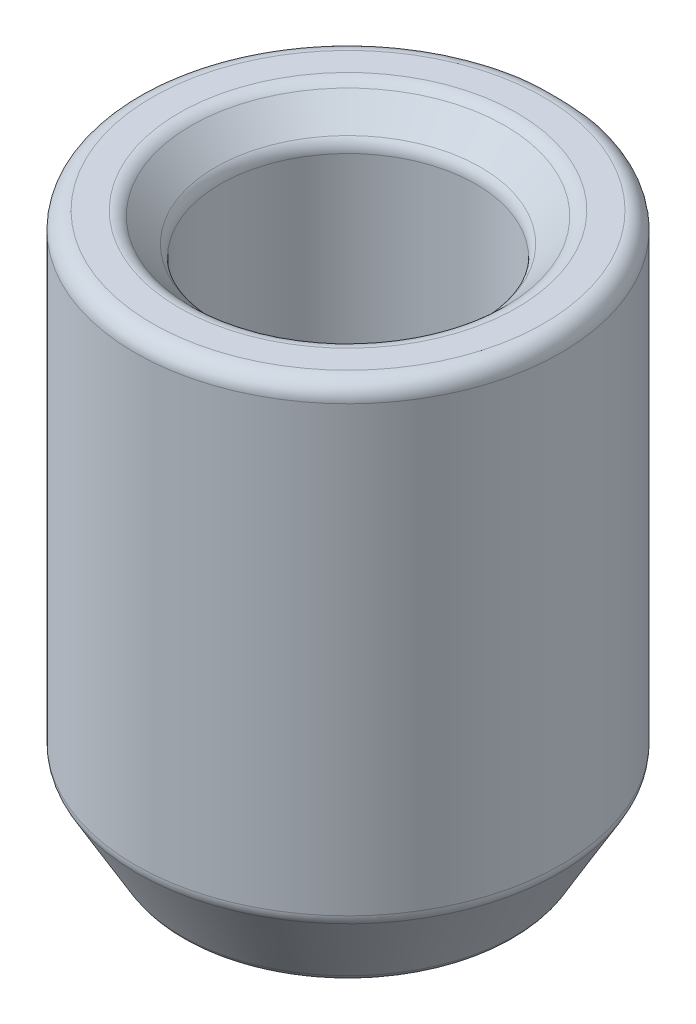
ISO-10303-21;
HEADER;
FILE_DESCRIPTION(('STEP AP214'),'2;1');
FILE_NAME('part.step','',(''),(''),'','','');
FILE_SCHEMA(('AUTOMOTIVE_DESIGN { 1 0 10303 214 1 1 1 1 }'));
ENDSEC;
DATA;
#1=APPLICATION_CONTEXT('core data for automotive mechanical design processes');
#2=APPLICATION_PROTOCOL_DEFINITION('international standard','automotive_design',2000,#1);
#3=PRODUCT_CONTEXT('',#1,'mechanical');
#4=PRODUCT('Part','Part','',(#3));
#5=PRODUCT_RELATED_PRODUCT_CATEGORY('part','',(#4));
#6=PRODUCT_DEFINITION_FORMATION('','',#4);
#7=PRODUCT_DEFINITION_CONTEXT('part definition',#1,'design');
#8=PRODUCT_DEFINITION('design','',#6,#7);
#9=PRODUCT_DEFINITION_SHAPE('','',#8);
#10=(LENGTH_UNIT() NAMED_UNIT(*) SI_UNIT(.MILLI.,.METRE.));
#11=(NAMED_UNIT(*) PLANE_ANGLE_UNIT() SI_UNIT($,.RADIAN.));
#12=(NAMED_UNIT(*) SI_UNIT($,.STERADIAN.) SOLID_ANGLE_UNIT());
#13=UNCERTAINTY_MEASURE_WITH_UNIT(LENGTH_MEASURE(1.E-05),#10,'distance_accuracy_value','');
#14=(GEOMETRIC_REPRESENTATION_CONTEXT(3) GLOBAL_UNCERTAINTY_ASSIGNED_CONTEXT((#13)) GLOBAL_UNIT_ASSIGNED_CONTEXT((#10,
#11,#12)) REPRESENTATION_CONTEXT('',''));
#15=CARTESIAN_POINT('',(0.,0.,0.));
#16=DIRECTION('',(0.,0.,1.));
#17=DIRECTION('',(1.,0.,0.));
#18=AXIS2_PLACEMENT_3D('',#15,#16,#17);
#19=CARTESIAN_POINT('',(1.25,3.25,0.));
#20=DIRECTION('',(0.,1.,0.));
#21=DIRECTION('',(0.,0.,1.));
#22=AXIS2_PLACEMENT_3D('',#19,#20,#21);
#23=PLANE('',#22);
#24=CARTESIAN_POINT('',(0.,3.25,0.));
#25=DIRECTION('',(0.,1.,0.));
#26=DIRECTION('',(0.,0.,1.));
#27=AXIS2_PLACEMENT_3D('',#24,#25,#26);
#28=CIRCLE('',#27,0.991421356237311);
#29=CARTESIAN_POINT('',(0.,3.25,0.991421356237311));
#30=VERTEX_POINT('',#29);
#31=EDGE_CURVE('E75',#30,#30,#28,.F.);
#32=ORIENTED_EDGE('',*,*,#31,.T.);
#33=EDGE_LOOP('',(#32));
#34=FACE_BOUND('',#33,.T.);
#35=CARTESIAN_POINT('',(0.,3.25,0.));
#36=DIRECTION('',(0.,1.,0.));
#37=DIRECTION('',(0.,0.,1.));
#38=AXIS2_PLACEMENT_3D('',#35,#36,#37);
#39=CIRCLE('',#38,1.15);
#40=CARTESIAN_POINT('',(0.322,3.25,-1.104));
#41=VERTEX_POINT('',#40);
#42=EDGE_CURVE('E30',#41,#41,#39,.T.);
#43=ORIENTED_EDGE('',*,*,#42,.T.);
#44=EDGE_LOOP('',(#43));
#45=FACE_BOUND('',#44,.T.);
#46=ADVANCED_FACE('F16',(#34,#45),#23,.T.);
#47=CARTESIAN_POINT('',(0.,-0.940962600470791,0.));
#48=DIRECTION('',(0.,-1.,0.));
#49=DIRECTION('',(0.,0.,-1.));
#50=AXIS2_PLACEMENT_3D('',#47,#48,#49);
#51=CYLINDRICAL_SURFACE('',#50,1.25);
#52=DIRECTION('',(0.,-1.,0.));
#53=VECTOR('',#52,1.);
#54=CARTESIAN_POINT('',(0.35,3.25,-1.2));
#55=LINE('',#54,#53);
#56=CARTESIAN_POINT('',(0.35,3.15,-1.2));
#57=VERTEX_POINT('',#56);
#58=CARTESIAN_POINT('',(0.35,0.546410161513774,-1.2));
#59=VERTEX_POINT('',#58);
#60=EDGE_CURVE('E56',#57,#59,#55,.T.);
#61=ORIENTED_EDGE('',*,*,#60,.F.);
#62=CARTESIAN_POINT('',(0.,3.15,0.));
#63=DIRECTION('',(0.,1.,0.));
#64=DIRECTION('',(0.,0.,1.));
#65=AXIS2_PLACEMENT_3D('',#62,#63,#64);
#66=CIRCLE('',#65,1.25);
#67=CARTESIAN_POINT('',(-0.35,3.15,-1.2));
#68=VERTEX_POINT('',#67);
#69=EDGE_CURVE('E67',#57,#68,#66,.F.);
#70=ORIENTED_EDGE('',*,*,#69,.T.);
#71=DIRECTION('',(0.,-1.,0.));
#72=VECTOR('',#71,1.);
#73=CARTESIAN_POINT('',(-0.35,3.25,-1.2));
#74=LINE('',#73,#72);
#75=CARTESIAN_POINT('',(-0.35,0.546410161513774,-1.2));
#76=VERTEX_POINT('',#75);
#77=EDGE_CURVE('E58',#68,#76,#74,.T.);
#78=ORIENTED_EDGE('',*,*,#77,.T.);
#79=CARTESIAN_POINT('',(0.,0.546410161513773,0.));
#80=DIRECTION('',(0.,-1.,0.));
#81=DIRECTION('',(0.,0.,-1.));
#82=AXIS2_PLACEMENT_3D('',#79,#80,#81);
#83=CIRCLE('',#82,1.25);
#84=EDGE_CURVE('E69',#76,#59,#83,.F.);
#85=ORIENTED_EDGE('',*,*,#84,.T.);
#86=EDGE_LOOP('',(#61,#70,#78,#85));
#87=FACE_BOUND('',#86,.T.);
#88=ADVANCED_FACE('F66',(#87),#51,.T.);
#89=CARTESIAN_POINT('',(0.,0.,0.));
#90=DIRECTION('',(0.,1.,0.));
#91=DIRECTION('',(0.,0.,1.));
#92=AXIS2_PLACEMENT_3D('',#89,#90,#91);
#93=CONICAL_SURFACE('',#92,0.95,0.523598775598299);
#94=CARTESIAN_POINT('',(0.,0.05,0.));
#95=DIRECTION('',(0.,-1.,0.));
#96=DIRECTION('',(0.,0.,-1.));
#97=AXIS2_PLACEMENT_3D('',#94,#95,#96);
#98=CIRCLE('',#97,0.978867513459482);
#99=CARTESIAN_POINT('',(0.,0.05,-0.978867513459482));
#100=VERTEX_POINT('',#99);
#101=EDGE_CURVE('E62',#100,#100,#98,.F.);
#102=ORIENTED_EDGE('',*,*,#101,.T.);
#103=EDGE_LOOP('',(#102));
#104=FACE_BOUND('',#103,.T.);
#105=CARTESIAN_POINT('',(-1.69990741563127,1.95858498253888,-1.2));
#106=CARTESIAN_POINT('',(-1.64529047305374,1.88136673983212,-1.2));
#107=CARTESIAN_POINT('',(-1.59014059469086,1.80450944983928,-1.2));
#108=CARTESIAN_POINT('',(-1.47824642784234,1.65181540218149,-1.2));
#109=CARTESIAN_POINT('',(-1.4215001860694,1.57598007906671,-1.2));
#110=CARTESIAN_POINT('',(-1.30479796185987,1.42423646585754,-1.2));
#111=CARTESIAN_POINT('',(-1.24479943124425,1.34836073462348,-1.2));
#112=CARTESIAN_POINT('',(-1.12197769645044,1.19897037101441,-1.2));
#113=CARTESIAN_POINT('',(-1.05915615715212,1.12545438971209,-1.2));
#114=CARTESIAN_POINT('',(-0.958705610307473,1.01446205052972,-1.2));
#115=CARTESIAN_POINT('',(-0.922504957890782,0.975696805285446,-1.2));
#116=CARTESIAN_POINT('',(-0.848574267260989,0.899659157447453,-1.2));
#117=CARTESIAN_POINT('',(-0.81084457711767,0.862386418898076,-1.2));
#118=CARTESIAN_POINT('',(-0.733602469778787,0.789990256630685,-1.2));
#119=CARTESIAN_POINT('',(-0.694096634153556,0.754859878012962,-1.2));
#120=CARTESIAN_POINT('',(-0.612731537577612,0.687466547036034,-1.2));
#121=CARTESIAN_POINT('',(-0.570874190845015,0.655201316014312,-1.2));
#122=CARTESIAN_POINT('',(-0.481844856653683,0.593135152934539,-1.2));
#123=CARTESIAN_POINT('',(-0.434507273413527,0.563566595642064,-1.2));
#124=CARTESIAN_POINT('',(-0.336086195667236,0.511478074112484,-1.2));
#125=CARTESIAN_POINT('',(-0.285012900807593,0.488939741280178,-1.2));
#126=CARTESIAN_POINT('',(-0.192875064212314,0.458629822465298,-1.2));
#127=CARTESIAN_POINT('',(-0.152586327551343,0.448556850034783,-1.2));
#128=CARTESIAN_POINT('',(-0.0708904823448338,0.435450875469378,-1.2));
#129=CARTESIAN_POINT('',(-0.0294851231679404,0.432407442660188,-1.2));
#130=CARTESIAN_POINT('',(0.0532651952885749,0.433822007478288,-1.2));
#131=CARTESIAN_POINT('',(0.094609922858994,0.438293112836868,-1.2));
#132=CARTESIAN_POINT('',(0.175949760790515,0.454063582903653,-1.2));
#133=CARTESIAN_POINT('',(0.21594365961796,0.465368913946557,-1.2));
#134=CARTESIAN_POINT('',(0.313609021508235,0.50051121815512,-1.2));
#135=CARTESIAN_POINT('',(0.370021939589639,0.52779285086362,-1.2));
#136=CARTESIAN_POINT('',(0.451349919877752,0.57472194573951,-1.2));
#137=CARTESIAN_POINT('',(0.478063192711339,0.591487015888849,-1.2));
#138=CARTESIAN_POINT('',(0.53041184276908,0.6266147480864,-1.2));
#139=CARTESIAN_POINT('',(0.556047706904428,0.644976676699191,-1.2));
#140=CARTESIAN_POINT('',(0.632850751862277,0.702951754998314,-1.2));
#141=CARTESIAN_POINT('',(0.682482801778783,0.744586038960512,-1.2));
#142=CARTESIAN_POINT('',(0.77870401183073,0.831261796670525,-1.2));
#143=CARTESIAN_POINT('',(0.825289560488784,0.876307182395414,-1.2));
#144=CARTESIAN_POINT('',(0.916347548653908,0.968932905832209,-1.2));
#145=CARTESIAN_POINT('',(0.960807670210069,1.01652526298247,-1.2));
#146=CARTESIAN_POINT('',(1.04790550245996,1.11335174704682,-1.2));
#147=CARTESIAN_POINT('',(1.09054287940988,1.16258617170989,-1.2));
#148=CARTESIAN_POINT('',(1.17043595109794,1.25756361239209,-1.2));
#149=CARTESIAN_POINT('',(1.20782037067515,1.30319889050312,-1.2));
#150=CARTESIAN_POINT('',(1.28163555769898,1.39524280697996,-1.2));
#151=CARTESIAN_POINT('',(1.31806619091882,1.44165155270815,-1.2));
#152=CARTESIAN_POINT('',(1.38969935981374,1.53450725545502,-1.2));
#153=CARTESIAN_POINT('',(1.42491144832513,1.58094686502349,-1.2));
#154=CARTESIAN_POINT('',(1.4946764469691,1.67429900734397,-1.2));
#155=CARTESIAN_POINT('',(1.52922953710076,1.72121140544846,-1.2));
#156=CARTESIAN_POINT('',(1.56351832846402,1.76831339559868,-1.2));
#157=B_SPLINE_CURVE_WITH_KNOTS('',3,(#105,#106,#107,#108,#109,#110,#111,#112,#113,#114,#115,
#116,#117,#118,#119,#120,#121,#122,#123,#124,#125,#126,#127,#128,#129,#130,#131,#132,#133,#134,
#135,#136,#137,#138,#139,#140,#141,#142,#143,#144,#145,#146,#147,#148,#149,#150,#151,#152,#153,
#154,#155,#156),.UNSPECIFIED.,.F.,.F.,(4,2,2,2,2,2,2,2,2,2,2,2,2,2,2,2,2,2,2,2,2,2,2,2,2,4),(0.,
0.283762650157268,0.567889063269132,0.858040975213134,1.14802395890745,1.30711208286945,
1.4661641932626,1.62466896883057,1.78304653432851,1.95011473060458,2.11674268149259,
2.24080792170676,2.36468895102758,2.48878629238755,2.61299212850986,2.79984676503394,
2.89443418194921,2.98897838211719,3.18305878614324,3.37736524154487,3.57268733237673,
3.76804503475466,3.94500882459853,4.12199738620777,4.29683065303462,4.4716154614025),.UNSPECIFIED.);
#158=CARTESIAN_POINT('',(-0.298639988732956,0.496410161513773,-1.2));
#159=VERTEX_POINT('',#158);
#160=CARTESIAN_POINT('',(0.298639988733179,0.496410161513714,-1.2));
#161=VERTEX_POINT('',#160);
#162=EDGE_CURVE('E133',#159,#161,#157,.T.);
#163=ORIENTED_EDGE('',*,*,#162,.T.);
#164=CARTESIAN_POINT('',(0.,0.496410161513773,0.));
#165=DIRECTION('',(0.,-1.,0.));
#166=DIRECTION('',(0.,0.,-1.));
#167=AXIS2_PLACEMENT_3D('',#164,#165,#166);
#168=CIRCLE('',#167,1.23660254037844);
#169=EDGE_CURVE('E25',#161,#159,#168,.T.);
#170=ORIENTED_EDGE('',*,*,#169,.T.);
#171=EDGE_LOOP('',(#163,#170));
#172=FACE_BOUND('',#171,.T.);
#173=ADVANCED_FACE('F113',(#104,#172),#93,.T.);
#174=CARTESIAN_POINT('',(0.,1.4,0.));
#175=DIRECTION('',(0.,-1.,0.));
#176=DIRECTION('',(1.,0.,0.));
#177=AXIS2_PLACEMENT_3D('',#174,#175,#176);
#178=SPHERICAL_SURFACE('',#177,0.75);
#179=CARTESIAN_POINT('',(0.,1.4,0.));
#180=DIRECTION('',(0.,-1.,0.));
#181=DIRECTION('',(0.,0.,-1.));
#182=AXIS2_PLACEMENT_3D('',#179,#180,#181);
#183=CIRCLE('',#182,0.75);
#184=CARTESIAN_POINT('',(0.,1.4,-0.75));
#185=VERTEX_POINT('',#184);
#186=EDGE_CURVE('E20',#185,#185,#183,.T.);
#187=ORIENTED_EDGE('',*,*,#186,.F.);
#188=EDGE_LOOP('',(#187));
#189=FACE_BOUND('',#188,.T.);
#190=ADVANCED_FACE('F18',(#189),#178,.F.);
#191=CARTESIAN_POINT('',(0.,-0.940962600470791,0.));
#192=DIRECTION('',(0.,-1.,0.));
#193=DIRECTION('',(0.,0.,-1.));
#194=AXIS2_PLACEMENT_3D('',#191,#192,#193);
#195=CYLINDRICAL_SURFACE('',#194,0.75);
#196=CARTESIAN_POINT('',(0.,3.00857864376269,0.));
#197=DIRECTION('',(0.,-1.,0.));
#198=DIRECTION('',(0.,0.,-1.));
#199=AXIS2_PLACEMENT_3D('',#196,#197,#198);
#200=CIRCLE('',#199,0.75);
#201=CARTESIAN_POINT('',(0.,3.00857864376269,-0.75));
#202=VERTEX_POINT('',#201);
#203=EDGE_CURVE('E139',#202,#202,#200,.F.);
#204=ORIENTED_EDGE('',*,*,#203,.T.);
#205=EDGE_LOOP('',(#204));
#206=FACE_BOUND('',#205,.T.);
#207=ORIENTED_EDGE('',*,*,#186,.T.);
#208=EDGE_LOOP('',(#207));
#209=FACE_BOUND('',#208,.T.);
#210=ADVANCED_FACE('F118',(#206,#209),#195,.F.);
#211=CARTESIAN_POINT('',(0.,0.,0.));
#212=DIRECTION('',(0.,-1.,0.));
#213=DIRECTION('',(0.,0.,-1.));
#214=AXIS2_PLACEMENT_3D('',#211,#212,#213);
#215=PLANE('',#214);
#216=CARTESIAN_POINT('',(0.,0.,0.));
#217=DIRECTION('',(0.,-1.,0.));
#218=DIRECTION('',(0.,0.,-1.));
#219=AXIS2_PLACEMENT_3D('',#216,#217,#218);
#220=CIRCLE('',#219,0.892264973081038);
#221=CARTESIAN_POINT('',(0.,0.,-0.892264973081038));
#222=VERTEX_POINT('',#221);
#223=EDGE_CURVE('E11',#222,#222,#220,.T.);
#224=ORIENTED_EDGE('',*,*,#223,.T.);
#225=EDGE_LOOP('',(#224));
#226=FACE_BOUND('',#225,.T.);
#227=ADVANCED_FACE('F121',(#226),#215,.T.);
#228=CARTESIAN_POINT('',(0.,3.25,0.));
#229=DIRECTION('',(0.,1.,0.));
#230=DIRECTION('',(0.,0.,1.));
#231=AXIS2_PLACEMENT_3D('',#228,#229,#230);
#232=CONICAL_SURFACE('',#231,0.95,0.785398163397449);
#233=CARTESIAN_POINT('',(0.,3.07928932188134,0.));
#234=DIRECTION('',(0.,-1.,0.));
#235=DIRECTION('',(0.,0.,-1.));
#236=AXIS2_PLACEMENT_3D('',#233,#234,#235);
#237=CIRCLE('',#236,0.779289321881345);
#238=CARTESIAN_POINT('',(0.,3.07928932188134,-0.779289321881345));
#239=VERTEX_POINT('',#238);
#240=EDGE_CURVE('E145',#239,#239,#237,.T.);
#241=ORIENTED_EDGE('',*,*,#240,.T.);
#242=EDGE_LOOP('',(#241));
#243=FACE_BOUND('',#242,.T.);
#244=CARTESIAN_POINT('',(0.,3.22071067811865,0.));
#245=DIRECTION('',(0.,-1.,0.));
#246=DIRECTION('',(0.,0.,-1.));
#247=AXIS2_PLACEMENT_3D('',#244,#245,#246);
#248=CIRCLE('',#247,0.920710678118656);
#249=CARTESIAN_POINT('',(0.,3.22071067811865,-0.920710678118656));
#250=VERTEX_POINT('',#249);
#251=EDGE_CURVE('E142',#250,#250,#248,.F.);
#252=ORIENTED_EDGE('',*,*,#251,.T.);
#253=EDGE_LOOP('',(#252));
#254=FACE_BOUND('',#253,.T.);
#255=ADVANCED_FACE('F123',(#243,#254),#232,.F.);
#256=CARTESIAN_POINT('',(-0.35,3.25,-1.2));
#257=DIRECTION('',(0.,0.,-1.));
#258=DIRECTION('',(-1.,0.,0.));
#259=AXIS2_PLACEMENT_3D('',#256,#257,#258);
#260=PLANE('',#259);
#261=ORIENTED_EDGE('',*,*,#77,.F.);
#262=CARTESIAN_POINT('',(-0.35,3.15,-1.2));
#263=CARTESIAN_POINT('',(-0.350006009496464,3.151856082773,-1.2));
#264=CARTESIAN_POINT('',(-0.349815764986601,3.15370357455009,-1.2));
#265=CARTESIAN_POINT('',(-0.349100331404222,3.15730650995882,-1.2));
#266=CARTESIAN_POINT('',(-0.348579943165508,3.15906288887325,-1.2));
#267=CARTESIAN_POINT('',(-0.347111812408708,3.16284308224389,-1.2));
#268=CARTESIAN_POINT('',(-0.346094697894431,3.16483932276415,-1.2));
#269=CARTESIAN_POINT('',(-0.343752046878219,3.16865069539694,-1.2));
#270=CARTESIAN_POINT('',(-0.34242476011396,3.17046471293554,-1.2));
#271=CARTESIAN_POINT('',(-0.338578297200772,3.17508718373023,-1.2));
#272=CARTESIAN_POINT('',(-0.335863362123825,3.17773068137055,-1.2));
#273=CARTESIAN_POINT('',(-0.330092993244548,3.18260417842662,-1.2));
#274=CARTESIAN_POINT('',(-0.327036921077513,3.18483338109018,-1.2));
#275=CARTESIAN_POINT('',(-0.31517330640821,3.19263355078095,-1.2));
#276=CARTESIAN_POINT('',(-0.305708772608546,3.19718164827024,-1.2));
#277=CARTESIAN_POINT('',(-0.286266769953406,3.2049959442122,-1.2));
#278=CARTESIAN_POINT('',(-0.276286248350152,3.20825320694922,-1.2));
#279=CARTESIAN_POINT('',(-0.247696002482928,3.2162918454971,-1.2));
#280=CARTESIAN_POINT('',(-0.228810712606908,3.22008888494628,-1.2));
#281=CARTESIAN_POINT('',(-0.190789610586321,3.22617779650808,-1.2));
#282=CARTESIAN_POINT('',(-0.171653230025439,3.22846526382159,-1.2));
#283=CARTESIAN_POINT('',(-0.133287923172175,3.23206094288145,-1.2));
#284=CARTESIAN_POINT('',(-0.114058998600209,3.23336917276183,-1.2));
#285=CARTESIAN_POINT('',(-0.0755653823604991,3.23529665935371,-1.2));
#286=CARTESIAN_POINT('',(-0.056300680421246,3.23591567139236,-1.2));
#287=CARTESIAN_POINT('',(0.000951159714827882,3.23696904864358,-1.2));
#288=CARTESIAN_POINT('',(0.0389575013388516,3.23664073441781,-1.2));
#289=CARTESIAN_POINT('',(0.0959303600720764,3.23437825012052,-1.2));
#290=CARTESIAN_POINT('',(0.114932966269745,3.23332727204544,-1.2));
#291=CARTESIAN_POINT('',(0.152858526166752,3.23037796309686,-1.2));
#292=CARTESIAN_POINT('',(0.171781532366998,3.22848032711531,-1.2));
#293=CARTESIAN_POINT('',(0.209651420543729,3.22340245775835,-1.2));
#294=CARTESIAN_POINT('',(0.228597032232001,3.22021102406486,-1.2));
#295=CARTESIAN_POINT('',(0.256579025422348,3.21375614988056,-1.2));
#296=CARTESIAN_POINT('',(0.265806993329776,3.21133615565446,-1.2));
#297=CARTESIAN_POINT('',(0.28401471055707,3.20570822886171,-1.2));
#298=CARTESIAN_POINT('',(0.292994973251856,3.20250208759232,-1.2));
#299=CARTESIAN_POINT('',(0.305901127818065,3.196852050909,-1.2));
#300=CARTESIAN_POINT('',(0.310030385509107,3.19487671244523,-1.2));
#301=CARTESIAN_POINT('',(0.318100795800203,3.19055296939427,-1.2));
#302=CARTESIAN_POINT('',(0.322041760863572,3.18820420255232,-1.2));
#303=CARTESIAN_POINT('',(0.328762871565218,3.1835823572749,-1.2));
#304=CARTESIAN_POINT('',(0.3316082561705,3.18140529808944,-1.2));
#305=CARTESIAN_POINT('',(0.336964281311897,3.17666835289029,-1.2));
#306=CARTESIAN_POINT('',(0.339475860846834,3.17410958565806,-1.2));
#307=CARTESIAN_POINT('',(0.342929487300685,3.16977377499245,-1.2));
#308=CARTESIAN_POINT('',(0.344071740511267,3.16815753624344,-1.2));
#309=CARTESIAN_POINT('',(0.346112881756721,3.16477809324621,-1.2));
#310=CARTESIAN_POINT('',(0.347012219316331,3.16301516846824,-1.2));
#311=CARTESIAN_POINT('',(0.348379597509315,3.15963378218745,-1.2));
#312=CARTESIAN_POINT('',(0.34889221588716,3.15803360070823,-1.2));
#313=CARTESIAN_POINT('',(0.349641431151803,3.15476893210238,-1.2));
#314=CARTESIAN_POINT('',(0.349878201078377,3.1531044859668,-1.2));
#315=CARTESIAN_POINT('',(0.350048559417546,3.14975942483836,-1.2));
#316=CARTESIAN_POINT('',(0.349981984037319,3.1480788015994,-1.2));
#317=CARTESIAN_POINT('',(0.349557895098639,3.1447446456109,-1.2));
#318=CARTESIAN_POINT('',(0.349198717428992,3.14309132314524,-1.2));
#319=CARTESIAN_POINT('',(0.348700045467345,3.14148291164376,-1.2));
#320=B_SPLINE_CURVE_WITH_KNOTS('',3,(#262,#263,#264,#265,#266,#267,#268,#269,#270,#271,#272,
#273,#274,#275,#276,#277,#278,#279,#280,#281,#282,#283,#284,#285,#286,#287,#288,#289,#290,#291,
#292,#293,#294,#295,#296,#297,#298,#299,#300,#301,#302,#303,#304,#305,#306,#307,#308,#309,#310,
#311,#312,#313,#314,#315,#316,#317,#318,#319),.UNSPECIFIED.,.F.,.F.,(4,2,2,2,2,2,2,2,2,2,2,2,2,
2,2,2,2,2,2,2,2,2,2,2,2,2,2,2,4),(0.,0.00554474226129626,0.0110106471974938,0.0176940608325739,
0.0244161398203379,0.0357200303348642,0.0470454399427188,0.0783015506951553,0.10977040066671,
0.167402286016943,0.225201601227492,0.282999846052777,0.340818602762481,0.454769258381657,
0.511851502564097,0.568886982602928,0.626427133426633,0.655028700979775,0.683565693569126,
0.697285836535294,0.711019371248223,0.72174604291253,0.732441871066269,0.738363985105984,
0.744275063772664,0.749295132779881,0.754312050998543,0.75933167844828,0.764380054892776),.UNSPECIFIED.);
#321=EDGE_CURVE('E53',#68,#57,#320,.T.);
#322=ORIENTED_EDGE('',*,*,#321,.T.);
#323=ORIENTED_EDGE('',*,*,#60,.T.);
#324=CARTESIAN_POINT('',(0.35,0.546410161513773,-1.2));
#325=CARTESIAN_POINT('',(0.350006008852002,0.544553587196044,-1.2));
#326=CARTESIAN_POINT('',(0.349815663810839,0.542705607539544,-1.2));
#327=CARTESIAN_POINT('',(0.349100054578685,0.539102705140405,-1.2));
#328=CARTESIAN_POINT('',(0.348579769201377,0.537346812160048,-1.2));
#329=CARTESIAN_POINT('',(0.347111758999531,0.533566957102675,-1.2));
#330=CARTESIAN_POINT('',(0.346094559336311,0.531570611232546,-1.2));
#331=CARTESIAN_POINT('',(0.343751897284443,0.527759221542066,-1.2));
#332=CARTESIAN_POINT('',(0.342424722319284,0.525945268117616,-1.2));
#333=CARTESIAN_POINT('',(0.338581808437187,0.521327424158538,-1.2));
#334=CARTESIAN_POINT('',(0.335871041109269,0.518687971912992,-1.2));
#335=CARTESIAN_POINT('',(0.330102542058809,0.513812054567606,-1.2));
#336=CARTESIAN_POINT('',(0.327043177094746,0.511577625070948,-1.2));
#337=CARTESIAN_POINT('',(0.319877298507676,0.506873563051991,-1.2));
#338=CARTESIAN_POINT('',(0.315709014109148,0.504499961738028,-1.2));
#339=CARTESIAN_POINT('',(0.307250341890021,0.500182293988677,-1.2));
#340=CARTESIAN_POINT('',(0.302963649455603,0.498231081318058,-1.2));
#341=CARTESIAN_POINT('',(0.29863998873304,0.496410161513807,-1.2));
#342=B_SPLINE_CURVE_WITH_KNOTS('',3,(#324,#325,#326,#327,#328,#329,#330,#331,#332,#333,#334,
#335,#336,#337,#338,#339,#340,#341),.UNSPECIFIED.,.F.,.F.,(4,2,2,2,2,2,2,2,4),(0.,
0.00554620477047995,0.0110106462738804,0.0176944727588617,0.0244161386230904,0.0357031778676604,
0.0470454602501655,0.0614106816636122,0.0755096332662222),.UNSPECIFIED.);
#343=EDGE_CURVE('E37',#59,#161,#342,.T.);
#344=ORIENTED_EDGE('',*,*,#343,.T.);
#345=ORIENTED_EDGE('',*,*,#162,.F.);
#346=CARTESIAN_POINT('',(-0.298639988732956,0.496410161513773,-1.2));
#347=CARTESIAN_POINT('',(-0.304069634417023,0.498718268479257,-1.2));
#348=CARTESIAN_POINT('',(-0.309480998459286,0.501219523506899,-1.2));
#349=CARTESIAN_POINT('',(-0.320012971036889,0.506905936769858,-1.2));
#350=CARTESIAN_POINT('',(-0.325128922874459,0.510099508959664,-1.2));
#351=CARTESIAN_POINT('',(-0.331882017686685,0.515288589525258,-1.2));
#352=CARTESIAN_POINT('',(-0.333809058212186,0.516897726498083,-1.2));
#353=CARTESIAN_POINT('',(-0.337482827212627,0.520315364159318,-1.2));
#354=CARTESIAN_POINT('',(-0.339229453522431,0.522123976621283,-1.2));
#355=CARTESIAN_POINT('',(-0.342484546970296,0.526000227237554,-1.2));
#356=CARTESIAN_POINT('',(-0.343988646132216,0.528071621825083,-1.2));
#357=CARTESIAN_POINT('',(-0.346578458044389,0.532452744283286,-1.2));
#358=CARTESIAN_POINT('',(-0.347667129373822,0.534760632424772,-1.2));
#359=CARTESIAN_POINT('',(-0.348959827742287,0.538644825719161,-1.2));
#360=CARTESIAN_POINT('',(-0.349343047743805,0.540161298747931,-1.2));
#361=CARTESIAN_POINT('',(-0.349866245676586,0.543253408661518,-1.2));
#362=CARTESIAN_POINT('',(-0.350003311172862,0.54482953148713,-1.2));
#363=CARTESIAN_POINT('',(-0.35,0.546410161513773,-1.2));
#364=B_SPLINE_CURVE_WITH_KNOTS('',3,(#346,#347,#348,#349,#350,#351,#352,#353,#354,#355,#356,
#357,#358,#359,#360,#361,#362,#363),.UNSPECIFIED.,.F.,.F.,(4,2,2,2,2,2,2,2,4),(0.,
0.0177941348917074,0.03581803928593,0.0433384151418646,0.0508630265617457,0.0585108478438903,
0.0661031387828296,0.0707767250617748,0.0755052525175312),.UNSPECIFIED.);
#365=EDGE_CURVE('E72',#159,#76,#364,.T.);
#366=ORIENTED_EDGE('',*,*,#365,.T.);
#367=EDGE_LOOP('',(#261,#322,#323,#344,#345,#366));
#368=FACE_BOUND('',#367,.T.);
#369=ADVANCED_FACE('F55',(#368),#260,.T.);
#370=CARTESIAN_POINT('',(0.,3.00857864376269,0.));
#371=DIRECTION('',(0.,-1.,0.));
#372=DIRECTION('',(0.,0.,-1.));
#373=AXIS2_PLACEMENT_3D('',#370,#371,#372);
#374=TOROIDAL_SURFACE('',#373,0.85,0.1);
#375=ORIENTED_EDGE('',*,*,#240,.F.);
#376=EDGE_LOOP('',(#375));
#377=FACE_BOUND('',#376,.T.);
#378=ORIENTED_EDGE('',*,*,#203,.F.);
#379=EDGE_LOOP('',(#378));
#380=FACE_BOUND('',#379,.T.);
#381=ADVANCED_FACE('F131',(#377,#380),#374,.T.);
#382=CARTESIAN_POINT('',(0.,3.15,0.));
#383=DIRECTION('',(0.,1.,0.));
#384=DIRECTION('',(0.,0.,1.));
#385=AXIS2_PLACEMENT_3D('',#382,#383,#384);
#386=TOROIDAL_SURFACE('',#385,0.991421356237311,0.1);
#387=ORIENTED_EDGE('',*,*,#251,.F.);
#388=EDGE_LOOP('',(#387));
#389=FACE_BOUND('',#388,.T.);
#390=ORIENTED_EDGE('',*,*,#31,.F.);
#391=EDGE_LOOP('',(#390));
#392=FACE_BOUND('',#391,.T.);
#393=ADVANCED_FACE('F150',(#389,#392),#386,.T.);
#394=CARTESIAN_POINT('',(0.,3.15,0.));
#395=DIRECTION('',(0.,1.,0.));
#396=DIRECTION('',(0.,0.,1.));
#397=AXIS2_PLACEMENT_3D('',#394,#395,#396);
#398=TOROIDAL_SURFACE('',#397,1.15,0.1);
#399=ORIENTED_EDGE('',*,*,#42,.F.);
#400=EDGE_LOOP('',(#399));
#401=FACE_BOUND('',#400,.T.);
#402=ORIENTED_EDGE('',*,*,#321,.F.);
#403=ORIENTED_EDGE('',*,*,#69,.F.);
#404=EDGE_LOOP('',(#402,#403));
#405=FACE_BOUND('',#404,.T.);
#406=ADVANCED_FACE('F71',(#401,#405),#398,.T.);
#407=CARTESIAN_POINT('',(0.,0.546410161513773,0.));
#408=DIRECTION('',(0.,-1.,0.));
#409=DIRECTION('',(0.,0.,-1.));
#410=AXIS2_PLACEMENT_3D('',#407,#408,#409);
#411=TOROIDAL_SURFACE('',#410,1.15,0.1);
#412=ORIENTED_EDGE('',*,*,#365,.F.);
#413=ORIENTED_EDGE('',*,*,#169,.F.);
#414=ORIENTED_EDGE('',*,*,#343,.F.);
#415=ORIENTED_EDGE('',*,*,#84,.F.);
#416=EDGE_LOOP('',(#412,#413,#414,#415));
#417=FACE_BOUND('',#416,.T.);
#418=ADVANCED_FACE('F89',(#417),#411,.T.);
#419=CARTESIAN_POINT('',(0.,0.1,0.));
#420=DIRECTION('',(0.,-1.,0.));
#421=DIRECTION('',(0.,0.,-1.));
#422=AXIS2_PLACEMENT_3D('',#419,#420,#421);
#423=TOROIDAL_SURFACE('',#422,0.892264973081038,0.1);
#424=ORIENTED_EDGE('',*,*,#101,.F.);
#425=EDGE_LOOP('',(#424));
#426=FACE_BOUND('',#425,.T.);
#427=ORIENTED_EDGE('',*,*,#223,.F.);
#428=EDGE_LOOP('',(#427));
#429=FACE_BOUND('',#428,.T.);
#430=ADVANCED_FACE('F93',(#426,#429),#423,.T.);
#431=CLOSED_SHELL('',(#46,#88,#173,#190,#210,#227,#255,#369,#381,#393,#406,#418,#430));
#432=MANIFOLD_SOLID_BREP('B1',#431);
#433=ADVANCED_BREP_SHAPE_REPRESENTATION('',(#18,#432),#14);
#434=SHAPE_DEFINITION_REPRESENTATION(#9,#433);
ENDSEC;
END-ISO-10303-21;
